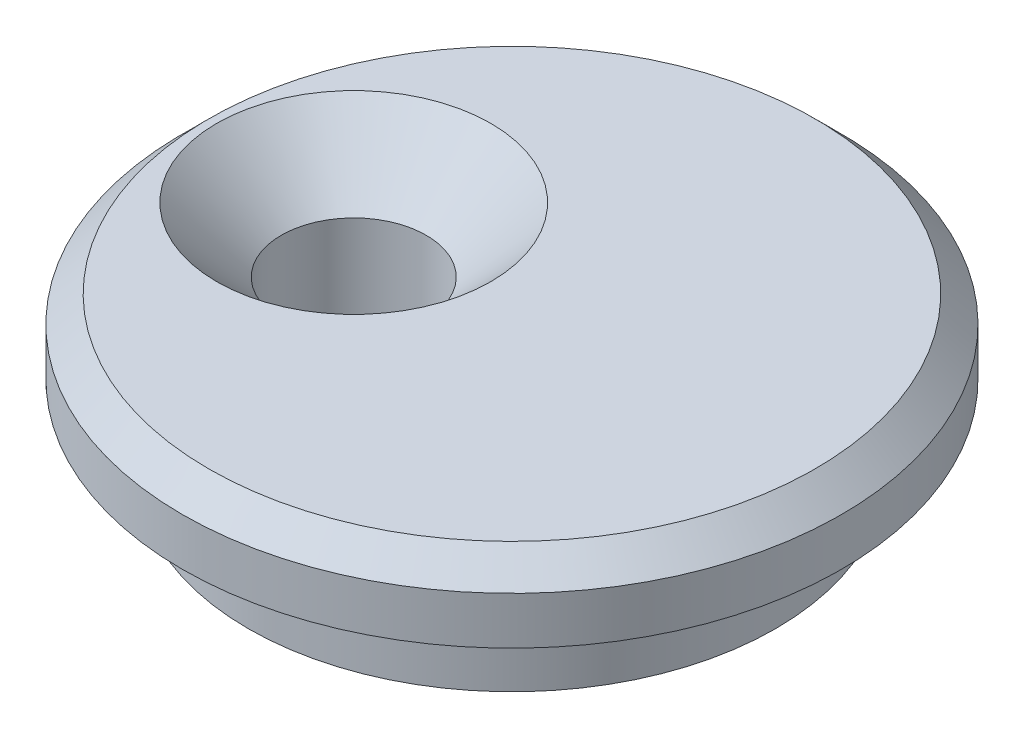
from build123d import *

# Parameters (mm, degrees)
SKETCH1_R                                           = 12.5
EXTRUDE1_DEPTH                                      = 2.8
CHAMFER1_SIZE                                       = 1
SKETCH2_R                                           = 10
EXTRUDE2_DEPTH                                      = 3.2
CSK_FOR_M5_COUNTERSUNK_FLAT_HEAD_SCREW1_D           = 5.5
CSK_FOR_M5_COUNTERSUNK_FLAT_HEAD_SCREW1_CSINK_D     = 10.4
CSK_FOR_M5_COUNTERSUNK_FLAT_HEAD_SCREW1_CSINK_ANGLE = 90


with BuildPart() as part:
    # Sketch1 → Extrude1 (new body)
    with BuildSketch(Plane(origin=(0, 0, 0), x_dir=(1, 0, 0), z_dir=(0, 1, 0))):
        with Locations(Location((0, 0, 0), (0, 0, 270))):
            Circle(SKETCH1_R)
    extrude(amount=-EXTRUDE1_DEPTH)

    # Chamfer1
    chamfer1_edges = [part.edges().sort_by_distance(p)[0] for p in [
        (0, 0, -12.5),
    ]]
    chamfer(chamfer1_edges, length=CHAMFER1_SIZE)

    # Sketch2 → Extrude2 (add)
    with BuildSketch(Plane.XZ.offset(2.8)):
        with Locations(Location((0, 0, 0), (0, 0, 90))):
            Circle(SKETCH2_R)
    extrude(amount=EXTRUDE2_DEPTH)

    # CSK for M5 Countersunk Flat Head Screw1 (through all)
    with Locations(Plane(origin=(-6, 0, 0), x_dir=(0, 0, 1), z_dir=(0, 1, 0))):
        with Locations((0, 0)):
            CounterSinkHole(CSK_FOR_M5_COUNTERSUNK_FLAT_HEAD_SCREW1_D / 2, CSK_FOR_M5_COUNTERSUNK_FLAT_HEAD_SCREW1_CSINK_D / 2, counter_sink_angle=CSK_FOR_M5_COUNTERSUNK_FLAT_HEAD_SCREW1_CSINK_ANGLE)


solid = part.part
